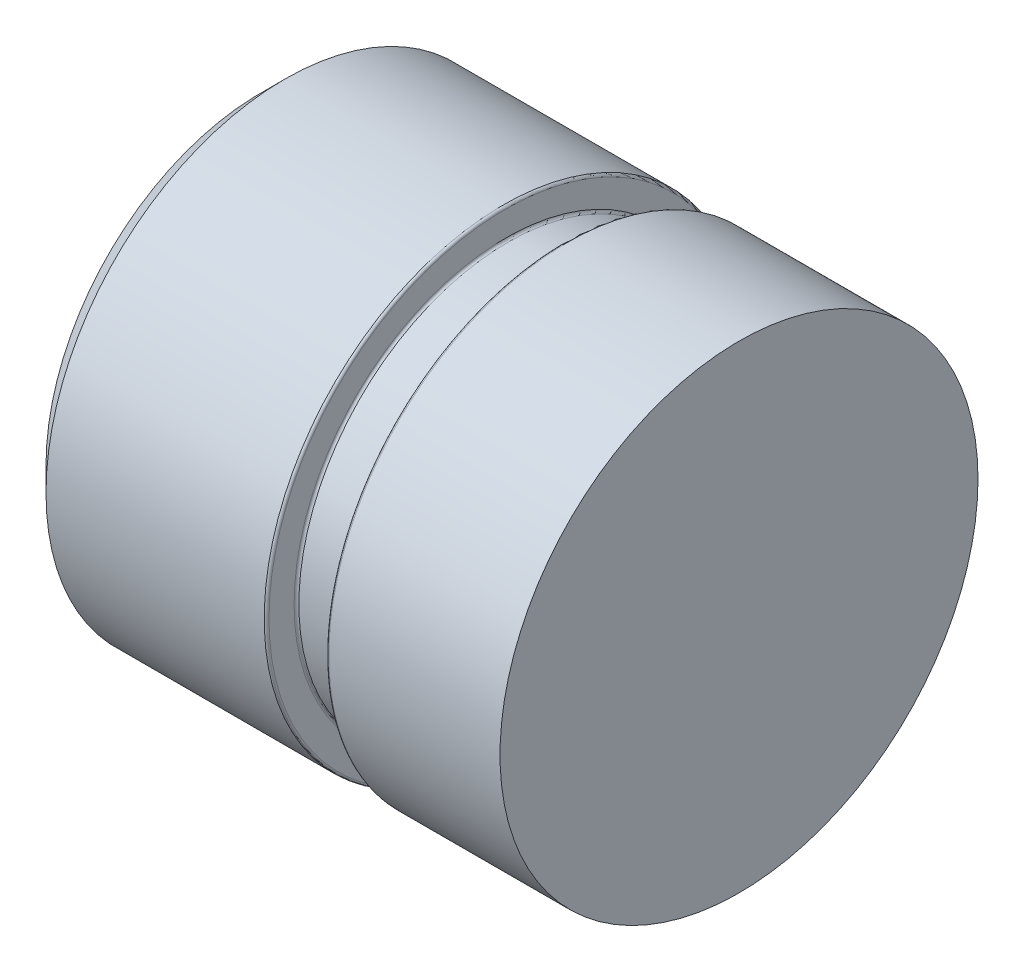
ISO-10303-21;
HEADER;
FILE_DESCRIPTION(('STEP AP214'),'2;1');
FILE_NAME('part.step','',(''),(''),'','','');
FILE_SCHEMA(('AUTOMOTIVE_DESIGN { 1 0 10303 214 1 1 1 1 }'));
ENDSEC;
DATA;
#1=APPLICATION_CONTEXT('core data for automotive mechanical design processes');
#2=APPLICATION_PROTOCOL_DEFINITION('international standard','automotive_design',2000,#1);
#3=PRODUCT_CONTEXT('',#1,'mechanical');
#4=PRODUCT('Part','Part','',(#3));
#5=PRODUCT_RELATED_PRODUCT_CATEGORY('part','',(#4));
#6=PRODUCT_DEFINITION_FORMATION('','',#4);
#7=PRODUCT_DEFINITION_CONTEXT('part definition',#1,'design');
#8=PRODUCT_DEFINITION('design','',#6,#7);
#9=PRODUCT_DEFINITION_SHAPE('','',#8);
#10=(LENGTH_UNIT() NAMED_UNIT(*) SI_UNIT(.MILLI.,.METRE.));
#11=(NAMED_UNIT(*) PLANE_ANGLE_UNIT() SI_UNIT($,.RADIAN.));
#12=(NAMED_UNIT(*) SI_UNIT($,.STERADIAN.) SOLID_ANGLE_UNIT());
#13=UNCERTAINTY_MEASURE_WITH_UNIT(LENGTH_MEASURE(1.E-05),#10,'distance_accuracy_value','');
#14=(GEOMETRIC_REPRESENTATION_CONTEXT(3) GLOBAL_UNCERTAINTY_ASSIGNED_CONTEXT((#13)) GLOBAL_UNIT_ASSIGNED_CONTEXT((#10,
#11,#12)) REPRESENTATION_CONTEXT('',''));
#15=CARTESIAN_POINT('',(0.,0.,0.));
#16=DIRECTION('',(0.,0.,1.));
#17=DIRECTION('',(1.,0.,0.));
#18=AXIS2_PLACEMENT_3D('',#15,#16,#17);
#19=CARTESIAN_POINT('',(0.,0.,0.));
#20=DIRECTION('',(1.,0.,0.));
#21=DIRECTION('',(0.,0.,-1.));
#22=AXIS2_PLACEMENT_3D('',#19,#20,#21);
#23=PLANE('',#22);
#24=CARTESIAN_POINT('',(0.,0.,0.));
#25=DIRECTION('',(1.,0.,0.));
#26=DIRECTION('',(0.,0.,-1.));
#27=AXIS2_PLACEMENT_3D('',#24,#25,#26);
#28=CIRCLE('',#27,25.4);
#29=CARTESIAN_POINT('',(0.,0.,-25.4));
#30=VERTEX_POINT('',#29);
#31=EDGE_CURVE('E43',#30,#30,#28,.T.);
#32=ORIENTED_EDGE('',*,*,#31,.T.);
#33=EDGE_LOOP('',(#32));
#34=FACE_BOUND('',#33,.T.);
#35=ADVANCED_FACE('F33',(#34),#23,.T.);
#36=CARTESIAN_POINT('',(15.8820536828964,0.,0.));
#37=DIRECTION('',(1.,0.,0.));
#38=DIRECTION('',(0.,0.,-1.));
#39=AXIS2_PLACEMENT_3D('',#36,#37,#38);
#40=CYLINDRICAL_SURFACE('',#39,25.4);
#41=CARTESIAN_POINT('',(-18.2035218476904,0.,0.));
#42=DIRECTION('',(1.,0.,0.));
#43=DIRECTION('',(0.,0.,-1.));
#44=AXIS2_PLACEMENT_3D('',#41,#42,#43);
#45=CIRCLE('',#44,25.4);
#46=CARTESIAN_POINT('',(-18.2035218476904,0.,-25.4));
#47=VERTEX_POINT('',#46);
#48=EDGE_CURVE('E47',#47,#47,#45,.T.);
#49=ORIENTED_EDGE('',*,*,#48,.T.);
#50=EDGE_LOOP('',(#49));
#51=FACE_BOUND('',#50,.T.);
#52=ORIENTED_EDGE('',*,*,#31,.F.);
#53=EDGE_LOOP('',(#52));
#54=FACE_BOUND('',#53,.T.);
#55=ADVANCED_FACE('F90',(#51,#54),#40,.T.);
#56=CARTESIAN_POINT('',(-18.2035218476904,0.,0.));
#57=DIRECTION('',(1.,0.,0.));
#58=DIRECTION('',(0.,0.,-1.));
#59=AXIS2_PLACEMENT_3D('',#56,#57,#58);
#60=TOROIDAL_SURFACE('',#59,25.146,0.254000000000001);
#61=CARTESIAN_POINT('',(-18.4575218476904,0.,0.));
#62=DIRECTION('',(1.,0.,0.));
#63=DIRECTION('',(0.,0.,-1.));
#64=AXIS2_PLACEMENT_3D('',#61,#62,#63);
#65=CIRCLE('',#64,25.146);
#66=CARTESIAN_POINT('',(-18.4575218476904,0.,-25.146));
#67=VERTEX_POINT('',#66);
#68=EDGE_CURVE('E52',#67,#67,#65,.T.);
#69=ORIENTED_EDGE('',*,*,#68,.T.);
#70=EDGE_LOOP('',(#69));
#71=FACE_BOUND('',#70,.T.);
#72=ORIENTED_EDGE('',*,*,#48,.F.);
#73=EDGE_LOOP('',(#72));
#74=FACE_BOUND('',#73,.T.);
#75=ADVANCED_FACE('F95',(#71,#74),#60,.T.);
#76=CARTESIAN_POINT('',(-18.4575218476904,25.146,0.));
#77=DIRECTION('',(-1.,0.,0.));
#78=DIRECTION('',(0.,0.,1.));
#79=AXIS2_PLACEMENT_3D('',#76,#77,#78);
#80=PLANE('',#79);
#81=CARTESIAN_POINT('',(-18.4575218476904,0.,0.));
#82=DIRECTION('',(1.,0.,0.));
#83=DIRECTION('',(0.,0.,-1.));
#84=AXIS2_PLACEMENT_3D('',#81,#82,#83);
#85=CIRCLE('',#84,22.479);
#86=CARTESIAN_POINT('',(-18.4575218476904,0.,-22.479));
#87=VERTEX_POINT('',#86);
#88=EDGE_CURVE('E55',#87,#87,#85,.T.);
#89=ORIENTED_EDGE('',*,*,#88,.T.);
#90=EDGE_LOOP('',(#89));
#91=FACE_BOUND('',#90,.T.);
#92=ORIENTED_EDGE('',*,*,#68,.F.);
#93=EDGE_LOOP('',(#92));
#94=FACE_BOUND('',#93,.T.);
#95=ADVANCED_FACE('F102',(#91,#94),#80,.T.);
#96=CARTESIAN_POINT('',(-18.7115218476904,0.,0.));
#97=DIRECTION('',(1.,0.,0.));
#98=DIRECTION('',(0.,0.,-1.));
#99=AXIS2_PLACEMENT_3D('',#96,#97,#98);
#100=TOROIDAL_SURFACE('',#99,22.479,0.254000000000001);
#101=CARTESIAN_POINT('',(-18.7115218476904,0.,0.));
#102=DIRECTION('',(1.,0.,0.));
#103=DIRECTION('',(0.,0.,-1.));
#104=AXIS2_PLACEMENT_3D('',#101,#102,#103);
#105=CIRCLE('',#104,22.225);
#106=CARTESIAN_POINT('',(-18.7115218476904,0.,-22.225));
#107=VERTEX_POINT('',#106);
#108=EDGE_CURVE('E58',#107,#107,#105,.T.);
#109=ORIENTED_EDGE('',*,*,#108,.T.);
#110=EDGE_LOOP('',(#109));
#111=FACE_BOUND('',#110,.T.);
#112=ORIENTED_EDGE('',*,*,#88,.F.);
#113=EDGE_LOOP('',(#112));
#114=FACE_BOUND('',#113,.T.);
#115=ADVANCED_FACE('F108',(#111,#114),#100,.F.);
#116=CARTESIAN_POINT('',(15.8820536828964,0.,0.));
#117=DIRECTION('',(1.,0.,0.));
#118=DIRECTION('',(0.,0.,-1.));
#119=AXIS2_PLACEMENT_3D('',#116,#117,#118);
#120=CYLINDRICAL_SURFACE('',#119,22.225);
#121=CARTESIAN_POINT('',(-24.5535218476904,0.,0.));
#122=DIRECTION('',(1.,0.,0.));
#123=DIRECTION('',(0.,0.,-1.));
#124=AXIS2_PLACEMENT_3D('',#121,#122,#123);
#125=CIRCLE('',#124,22.225);
#126=CARTESIAN_POINT('',(-24.5535218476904,0.,-22.225));
#127=VERTEX_POINT('',#126);
#128=EDGE_CURVE('E61',#127,#127,#125,.T.);
#129=ORIENTED_EDGE('',*,*,#128,.T.);
#130=EDGE_LOOP('',(#129));
#131=FACE_BOUND('',#130,.T.);
#132=ORIENTED_EDGE('',*,*,#108,.F.);
#133=EDGE_LOOP('',(#132));
#134=FACE_BOUND('',#133,.T.);
#135=ADVANCED_FACE('F112',(#131,#134),#120,.T.);
#136=CARTESIAN_POINT('',(-24.5535218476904,0.,0.));
#137=DIRECTION('',(1.,0.,0.));
#138=DIRECTION('',(0.,0.,-1.));
#139=AXIS2_PLACEMENT_3D('',#136,#137,#138);
#140=TOROIDAL_SURFACE('',#139,22.479,0.254000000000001);
#141=CARTESIAN_POINT('',(-24.8075218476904,0.,0.));
#142=DIRECTION('',(1.,0.,0.));
#143=DIRECTION('',(0.,0.,-1.));
#144=AXIS2_PLACEMENT_3D('',#141,#142,#143);
#145=CIRCLE('',#144,22.479);
#146=CARTESIAN_POINT('',(-24.8075218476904,0.,-22.479));
#147=VERTEX_POINT('',#146);
#148=EDGE_CURVE('E64',#147,#147,#145,.T.);
#149=ORIENTED_EDGE('',*,*,#148,.T.);
#150=EDGE_LOOP('',(#149));
#151=FACE_BOUND('',#150,.T.);
#152=ORIENTED_EDGE('',*,*,#128,.F.);
#153=EDGE_LOOP('',(#152));
#154=FACE_BOUND('',#153,.T.);
#155=ADVANCED_FACE('F116',(#151,#154),#140,.F.);
#156=CARTESIAN_POINT('',(-24.8075218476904,22.479,0.));
#157=DIRECTION('',(1.,0.,0.));
#158=DIRECTION('',(0.,0.,-1.));
#159=AXIS2_PLACEMENT_3D('',#156,#157,#158);
#160=PLANE('',#159);
#161=CARTESIAN_POINT('',(-24.8075218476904,0.,0.));
#162=DIRECTION('',(1.,0.,0.));
#163=DIRECTION('',(0.,0.,-1.));
#164=AXIS2_PLACEMENT_3D('',#161,#162,#163);
#165=CIRCLE('',#164,25.146);
#166=CARTESIAN_POINT('',(-24.8075218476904,0.,-25.146));
#167=VERTEX_POINT('',#166);
#168=EDGE_CURVE('E67',#167,#167,#165,.T.);
#169=ORIENTED_EDGE('',*,*,#168,.T.);
#170=EDGE_LOOP('',(#169));
#171=FACE_BOUND('',#170,.T.);
#172=ORIENTED_EDGE('',*,*,#148,.F.);
#173=EDGE_LOOP('',(#172));
#174=FACE_BOUND('',#173,.T.);
#175=ADVANCED_FACE('F87',(#171,#174),#160,.T.);
#176=CARTESIAN_POINT('',(-25.0615218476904,0.,0.));
#177=DIRECTION('',(1.,0.,0.));
#178=DIRECTION('',(0.,0.,-1.));
#179=AXIS2_PLACEMENT_3D('',#176,#177,#178);
#180=TOROIDAL_SURFACE('',#179,25.146,0.254000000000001);
#181=CARTESIAN_POINT('',(-25.0615218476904,0.,0.));
#182=DIRECTION('',(1.,0.,0.));
#183=DIRECTION('',(0.,0.,-1.));
#184=AXIS2_PLACEMENT_3D('',#181,#182,#183);
#185=CIRCLE('',#184,25.4);
#186=CARTESIAN_POINT('',(-25.0615218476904,0.,-25.4));
#187=VERTEX_POINT('',#186);
#188=EDGE_CURVE('E70',#187,#187,#185,.T.);
#189=ORIENTED_EDGE('',*,*,#188,.T.);
#190=EDGE_LOOP('',(#189));
#191=FACE_BOUND('',#190,.T.);
#192=ORIENTED_EDGE('',*,*,#168,.F.);
#193=EDGE_LOOP('',(#192));
#194=FACE_BOUND('',#193,.T.);
#195=ADVANCED_FACE('F74',(#191,#194),#180,.T.);
#196=CARTESIAN_POINT('',(15.8820536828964,0.,0.));
#197=DIRECTION('',(1.,0.,0.));
#198=DIRECTION('',(0.,0.,-1.));
#199=AXIS2_PLACEMENT_3D('',#196,#197,#198);
#200=CYLINDRICAL_SURFACE('',#199,25.4);
#201=CARTESIAN_POINT('',(-48.2539554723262,0.,0.));
#202=DIRECTION('',(-1.,0.,0.));
#203=DIRECTION('',(0.,0.,1.));
#204=AXIS2_PLACEMENT_3D('',#201,#202,#203);
#205=CIRCLE('',#204,25.4);
#206=CARTESIAN_POINT('',(-48.2539554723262,0.,25.4));
#207=VERTEX_POINT('',#206);
#208=EDGE_CURVE('E39',#207,#207,#205,.F.);
#209=ORIENTED_EDGE('',*,*,#208,.T.);
#210=EDGE_LOOP('',(#209));
#211=FACE_BOUND('',#210,.T.);
#212=ORIENTED_EDGE('',*,*,#188,.F.);
#213=EDGE_LOOP('',(#212));
#214=FACE_BOUND('',#213,.T.);
#215=ADVANCED_FACE('F77',(#211,#214),#200,.T.);
#216=CARTESIAN_POINT('',(-50.7939554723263,25.4,0.));
#217=DIRECTION('',(-1.,0.,0.));
#218=DIRECTION('',(0.,0.,1.));
#219=AXIS2_PLACEMENT_3D('',#216,#217,#218);
#220=PLANE('',#219);
#221=CARTESIAN_POINT('',(-50.7939554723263,0.,0.));
#222=DIRECTION('',(-1.,0.,0.));
#223=DIRECTION('',(0.,0.,1.));
#224=AXIS2_PLACEMENT_3D('',#221,#222,#223);
#225=CIRCLE('',#224,22.86);
#226=CARTESIAN_POINT('',(-50.7939554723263,0.,22.86));
#227=VERTEX_POINT('',#226);
#228=EDGE_CURVE('E10',#227,#227,#225,.T.);
#229=ORIENTED_EDGE('',*,*,#228,.T.);
#230=EDGE_LOOP('',(#229));
#231=FACE_BOUND('',#230,.T.);
#232=ADVANCED_FACE('F79',(#231),#220,.T.);
#233=CARTESIAN_POINT('',(-48.2539554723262,0.,0.));
#234=DIRECTION('',(1.,0.,0.));
#235=DIRECTION('',(0.,0.,-1.));
#236=AXIS2_PLACEMENT_3D('',#233,#234,#235);
#237=CONICAL_SURFACE('',#236,25.4,0.785398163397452);
#238=ORIENTED_EDGE('',*,*,#228,.F.);
#239=EDGE_LOOP('',(#238));
#240=FACE_BOUND('',#239,.T.);
#241=ORIENTED_EDGE('',*,*,#208,.F.);
#242=EDGE_LOOP('',(#241));
#243=FACE_BOUND('',#242,.T.);
#244=ADVANCED_FACE('F85',(#240,#243),#237,.T.);
#245=CLOSED_SHELL('',(#35,#55,#75,#95,#115,#135,#155,#175,#195,#215,#232,#244));
#246=MANIFOLD_SOLID_BREP('B2',#245);
#247=ADVANCED_BREP_SHAPE_REPRESENTATION('',(#18,#246),#14);
#248=SHAPE_DEFINITION_REPRESENTATION(#9,#247);
ENDSEC;
END-ISO-10303-21;
